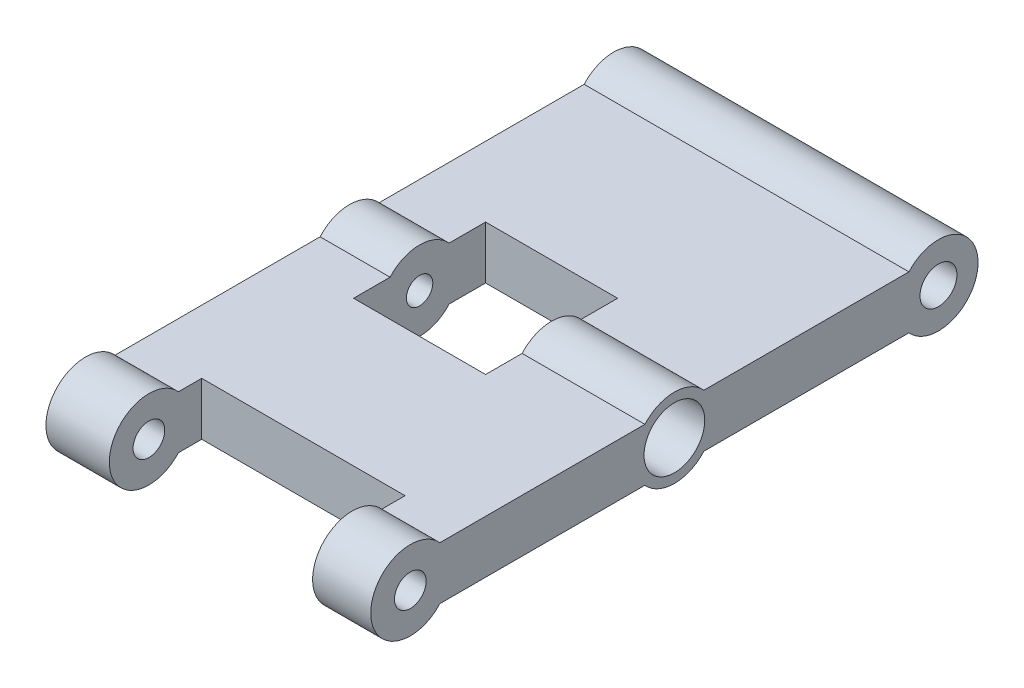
ISO-10303-21;
HEADER;
FILE_DESCRIPTION(('STEP AP214'),'2;1');
FILE_NAME('part.step','',(''),(''),'','','');
FILE_SCHEMA(('AUTOMOTIVE_DESIGN { 1 0 10303 214 1 1 1 1 }'));
ENDSEC;
DATA;
#1=APPLICATION_CONTEXT('core data for automotive mechanical design processes');
#2=APPLICATION_PROTOCOL_DEFINITION('international standard','automotive_design',2000,#1);
#3=PRODUCT_CONTEXT('',#1,'mechanical');
#4=PRODUCT('Part','Part','',(#3));
#5=PRODUCT_RELATED_PRODUCT_CATEGORY('part','',(#4));
#6=PRODUCT_DEFINITION_FORMATION('','',#4);
#7=PRODUCT_DEFINITION_CONTEXT('part definition',#1,'design');
#8=PRODUCT_DEFINITION('design','',#6,#7);
#9=PRODUCT_DEFINITION_SHAPE('','',#8);
#10=(LENGTH_UNIT() NAMED_UNIT(*) SI_UNIT(.MILLI.,.METRE.));
#11=(NAMED_UNIT(*) PLANE_ANGLE_UNIT() SI_UNIT($,.RADIAN.));
#12=(NAMED_UNIT(*) SI_UNIT($,.STERADIAN.) SOLID_ANGLE_UNIT());
#13=UNCERTAINTY_MEASURE_WITH_UNIT(LENGTH_MEASURE(1.E-05),#10,'distance_accuracy_value','');
#14=(GEOMETRIC_REPRESENTATION_CONTEXT(3) GLOBAL_UNCERTAINTY_ASSIGNED_CONTEXT((#13)) GLOBAL_UNIT_ASSIGNED_CONTEXT((#10,
#11,#12)) REPRESENTATION_CONTEXT('',''));
#15=CARTESIAN_POINT('',(0.,0.,0.));
#16=DIRECTION('',(0.,0.,1.));
#17=DIRECTION('',(1.,0.,0.));
#18=AXIS2_PLACEMENT_3D('',#15,#16,#17);
#19=CARTESIAN_POINT('',(31.242,2.54,-25.4));
#20=DIRECTION('',(-1.,0.,0.));
#21=DIRECTION('',(0.,0.,1.));
#22=AXIS2_PLACEMENT_3D('',#19,#20,#21);
#23=CYLINDRICAL_SURFACE('',#22,1.27);
#24=CARTESIAN_POINT('',(6.731,2.54,-25.4));
#25=DIRECTION('',(-1.,0.,0.));
#26=DIRECTION('',(0.,0.,1.));
#27=AXIS2_PLACEMENT_3D('',#24,#25,#26);
#28=CIRCLE('',#27,1.27);
#29=CARTESIAN_POINT('',(6.731,2.54,-24.13));
#30=VERTEX_POINT('',#29);
#31=EDGE_CURVE('E211',#30,#30,#28,.F.);
#32=CARTESIAN_POINT('',(4.191,2.54,-25.4));
#33=DIRECTION('',(-1.,0.,0.));
#34=DIRECTION('',(0.,0.,1.));
#35=AXIS2_PLACEMENT_3D('',#32,#33,#34);
#36=CIRCLE('',#35,1.27);
#37=CARTESIAN_POINT('',(4.191,2.54,-24.13));
#38=VERTEX_POINT('',#37);
#39=EDGE_CURVE('E39',#38,#38,#36,.F.);
#40=CARTESIAN_POINT('',(6.731,2.54,-24.13));
#41=CARTESIAN_POINT('',(6.70454166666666,2.54,-24.13));
#42=CARTESIAN_POINT('',(6.67808333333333,2.54,-24.13));
#43=CARTESIAN_POINT('',(6.62516666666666,2.54,-24.13));
#44=CARTESIAN_POINT('',(6.59870833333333,2.54,-24.13));
#45=CARTESIAN_POINT('',(6.54579166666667,2.54,-24.13));
#46=CARTESIAN_POINT('',(6.51933333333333,2.54,-24.13));
#47=CARTESIAN_POINT('',(6.46641666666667,2.54,-24.13));
#48=CARTESIAN_POINT('',(6.43995833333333,2.54,-24.13));
#49=CARTESIAN_POINT('',(6.38704166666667,2.54,-24.13));
#50=CARTESIAN_POINT('',(6.36058333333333,2.54,-24.13));
#51=CARTESIAN_POINT('',(6.30766666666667,2.54,-24.13));
#52=CARTESIAN_POINT('',(6.28120833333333,2.54,-24.13));
#53=CARTESIAN_POINT('',(6.22829166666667,2.54,-24.13));
#54=CARTESIAN_POINT('',(6.20183333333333,2.54,-24.13));
#55=CARTESIAN_POINT('',(6.14891666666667,2.54,-24.13));
#56=CARTESIAN_POINT('',(6.12245833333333,2.54,-24.13));
#57=CARTESIAN_POINT('',(6.06954166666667,2.54,-24.13));
#58=CARTESIAN_POINT('',(6.04308333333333,2.54,-24.13));
#59=CARTESIAN_POINT('',(5.99016666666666,2.54,-24.13));
#60=CARTESIAN_POINT('',(5.96370833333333,2.54,-24.13));
#61=CARTESIAN_POINT('',(5.91079166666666,2.54,-24.13));
#62=CARTESIAN_POINT('',(5.88433333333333,2.54,-24.13));
#63=CARTESIAN_POINT('',(5.83141666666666,2.54,-24.13));
#64=CARTESIAN_POINT('',(5.80495833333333,2.54,-24.13));
#65=CARTESIAN_POINT('',(5.75204166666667,2.54,-24.13));
#66=CARTESIAN_POINT('',(5.72558333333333,2.54,-24.13));
#67=CARTESIAN_POINT('',(5.67266666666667,2.54,-24.13));
#68=CARTESIAN_POINT('',(5.64620833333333,2.54,-24.13));
#69=CARTESIAN_POINT('',(5.59329166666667,2.54,-24.13));
#70=CARTESIAN_POINT('',(5.56683333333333,2.54,-24.13));
#71=CARTESIAN_POINT('',(5.51391666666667,2.54,-24.13));
#72=CARTESIAN_POINT('',(5.48745833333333,2.54,-24.13));
#73=CARTESIAN_POINT('',(5.43454166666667,2.54,-24.13));
#74=CARTESIAN_POINT('',(5.40808333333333,2.54,-24.13));
#75=CARTESIAN_POINT('',(5.35516666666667,2.54,-24.13));
#76=CARTESIAN_POINT('',(5.32870833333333,2.54,-24.13));
#77=CARTESIAN_POINT('',(5.27579166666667,2.54,-24.13));
#78=CARTESIAN_POINT('',(5.24933333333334,2.54,-24.13));
#79=CARTESIAN_POINT('',(5.19641666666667,2.54,-24.13));
#80=CARTESIAN_POINT('',(5.16995833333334,2.54,-24.13));
#81=CARTESIAN_POINT('',(5.11704166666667,2.54,-24.13));
#82=CARTESIAN_POINT('',(5.09058333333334,2.54,-24.13));
#83=CARTESIAN_POINT('',(5.03766666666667,2.54,-24.13));
#84=CARTESIAN_POINT('',(5.01120833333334,2.54,-24.13));
#85=CARTESIAN_POINT('',(4.95829166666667,2.54,-24.13));
#86=CARTESIAN_POINT('',(4.93183333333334,2.54,-24.13));
#87=CARTESIAN_POINT('',(4.87891666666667,2.54,-24.13));
#88=CARTESIAN_POINT('',(4.85245833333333,2.54,-24.13));
#89=CARTESIAN_POINT('',(4.79954166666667,2.54,-24.13));
#90=CARTESIAN_POINT('',(4.77308333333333,2.54,-24.13));
#91=CARTESIAN_POINT('',(4.72016666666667,2.54,-24.13));
#92=CARTESIAN_POINT('',(4.69370833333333,2.54,-24.13));
#93=CARTESIAN_POINT('',(4.64079166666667,2.54,-24.13));
#94=CARTESIAN_POINT('',(4.61433333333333,2.54,-24.13));
#95=CARTESIAN_POINT('',(4.56141666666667,2.54,-24.13));
#96=CARTESIAN_POINT('',(4.53495833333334,2.54,-24.13));
#97=CARTESIAN_POINT('',(4.48204166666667,2.54,-24.13));
#98=CARTESIAN_POINT('',(4.45558333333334,2.54,-24.13));
#99=CARTESIAN_POINT('',(4.40266666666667,2.54,-24.13));
#100=CARTESIAN_POINT('',(4.37620833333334,2.54,-24.13));
#101=CARTESIAN_POINT('',(4.32329166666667,2.54,-24.13));
#102=CARTESIAN_POINT('',(4.29683333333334,2.54,-24.13));
#103=CARTESIAN_POINT('',(4.24391666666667,2.54,-24.13));
#104=CARTESIAN_POINT('',(4.21745833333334,2.54,-24.13));
#105=CARTESIAN_POINT('',(4.191,2.54,-24.13));
#106=B_SPLINE_CURVE_WITH_KNOTS('',3,(#40,#41,#42,#43,#44,#45,#46,#47,#48,#49,#50,#51,#52,#53,
#54,#55,#56,#57,#58,#59,#60,#61,#62,#63,#64,#65,#66,#67,#68,#69,#70,#71,#72,#73,#74,#75,#76,#77,
#78,#79,#80,#81,#82,#83,#84,#85,#86,#87,#88,#89,#90,#91,#92,#93,#94,#95,#96,#97,#98,#99,#100,
#101,#102,#103,#104,#105),.UNSPECIFIED.,.F.,.F.,(4,2,2,2,2,2,2,2,2,2,2,2,2,2,2,2,2,2,2,2,2,2,2,
2,2,2,2,2,2,2,2,2,4),(0.,0.0793749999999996,0.158749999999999,0.238124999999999,
0.317499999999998,0.396874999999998,0.476249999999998,0.555624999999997,0.634999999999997,
0.714375,0.793749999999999,0.873124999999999,0.952499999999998,1.031875,1.11125,1.190625,1.27,
1.349375,1.42875,1.508125,1.5875,1.66687499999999,1.74624999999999,1.82562499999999,1.905,
1.984375,2.06375,2.143125,2.2225,2.301875,2.38124999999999,2.46062499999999,2.53999999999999),.UNSPECIFIED.);
#107=EDGE_CURVE('BSEAM35',#30,#38,#106,.T.);
#108=ORIENTED_EDGE('',*,*,#31,.T.);
#109=ORIENTED_EDGE('',*,*,#39,.F.);
#110=ORIENTED_EDGE('',*,*,#107,.T.);
#111=ORIENTED_EDGE('',*,*,#107,.F.);
#112=EDGE_LOOP('',(#108,#110,#109,#111));
#113=FACE_BOUND('',#112,.T.);
#114=ADVANCED_FACE('F35',(#113),#23,.F.);
#115=CARTESIAN_POINT('',(19.431,2.54,-25.4));
#116=DIRECTION('',(1.,0.,0.));
#117=DIRECTION('',(0.,0.,-1.));
#118=AXIS2_PLACEMENT_3D('',#115,#116,#117);
#119=CIRCLE('',#118,1.27);
#120=CARTESIAN_POINT('',(19.431,2.54,-24.13));
#121=VERTEX_POINT('',#120);
#122=EDGE_CURVE('E333',#121,#121,#119,.F.);
#123=CARTESIAN_POINT('',(21.971,2.54,-25.4));
#124=DIRECTION('',(1.,0.,0.));
#125=DIRECTION('',(0.,0.,-1.));
#126=AXIS2_PLACEMENT_3D('',#123,#124,#125);
#127=CIRCLE('',#126,1.27);
#128=CARTESIAN_POINT('',(21.971,2.54,-24.13));
#129=VERTEX_POINT('',#128);
#130=EDGE_CURVE('E338',#129,#129,#127,.F.);
#131=CARTESIAN_POINT('',(19.431,2.54,-24.13));
#132=CARTESIAN_POINT('',(19.4574583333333,2.54,-24.13));
#133=CARTESIAN_POINT('',(19.4839166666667,2.54,-24.13));
#134=CARTESIAN_POINT('',(19.5368333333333,2.54,-24.13));
#135=CARTESIAN_POINT('',(19.5632916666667,2.54,-24.13));
#136=CARTESIAN_POINT('',(19.6162083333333,2.54,-24.13));
#137=CARTESIAN_POINT('',(19.6426666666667,2.54,-24.13));
#138=CARTESIAN_POINT('',(19.6955833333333,2.54,-24.13));
#139=CARTESIAN_POINT('',(19.7220416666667,2.54,-24.13));
#140=CARTESIAN_POINT('',(19.7749583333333,2.54,-24.13));
#141=CARTESIAN_POINT('',(19.8014166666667,2.54,-24.13));
#142=CARTESIAN_POINT('',(19.8543333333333,2.54,-24.13));
#143=CARTESIAN_POINT('',(19.8807916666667,2.54,-24.13));
#144=CARTESIAN_POINT('',(19.9337083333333,2.54,-24.13));
#145=CARTESIAN_POINT('',(19.9601666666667,2.54,-24.13));
#146=CARTESIAN_POINT('',(20.0130833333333,2.54,-24.13));
#147=CARTESIAN_POINT('',(20.0395416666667,2.54,-24.13));
#148=CARTESIAN_POINT('',(20.0924583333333,2.54,-24.13));
#149=CARTESIAN_POINT('',(20.1189166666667,2.54,-24.13));
#150=CARTESIAN_POINT('',(20.1718333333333,2.54,-24.13));
#151=CARTESIAN_POINT('',(20.1982916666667,2.54,-24.13));
#152=CARTESIAN_POINT('',(20.2512083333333,2.54,-24.13));
#153=CARTESIAN_POINT('',(20.2776666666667,2.54,-24.13));
#154=CARTESIAN_POINT('',(20.3305833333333,2.54,-24.13));
#155=CARTESIAN_POINT('',(20.3570416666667,2.54,-24.13));
#156=CARTESIAN_POINT('',(20.4099583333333,2.54,-24.13));
#157=CARTESIAN_POINT('',(20.4364166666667,2.54,-24.13));
#158=CARTESIAN_POINT('',(20.4893333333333,2.54,-24.13));
#159=CARTESIAN_POINT('',(20.5157916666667,2.54,-24.13));
#160=CARTESIAN_POINT('',(20.5687083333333,2.54,-24.13));
#161=CARTESIAN_POINT('',(20.5951666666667,2.54,-24.13));
#162=CARTESIAN_POINT('',(20.6480833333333,2.54,-24.13));
#163=CARTESIAN_POINT('',(20.6745416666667,2.54,-24.13));
#164=CARTESIAN_POINT('',(20.7274583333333,2.54,-24.13));
#165=CARTESIAN_POINT('',(20.7539166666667,2.54,-24.13));
#166=CARTESIAN_POINT('',(20.8068333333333,2.54,-24.13));
#167=CARTESIAN_POINT('',(20.8332916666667,2.54,-24.13));
#168=CARTESIAN_POINT('',(20.8862083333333,2.54,-24.13));
#169=CARTESIAN_POINT('',(20.9126666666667,2.54,-24.13));
#170=CARTESIAN_POINT('',(20.9655833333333,2.54,-24.13));
#171=CARTESIAN_POINT('',(20.9920416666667,2.54,-24.13));
#172=CARTESIAN_POINT('',(21.0449583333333,2.54,-24.13));
#173=CARTESIAN_POINT('',(21.0714166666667,2.54,-24.13));
#174=CARTESIAN_POINT('',(21.1243333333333,2.54,-24.13));
#175=CARTESIAN_POINT('',(21.1507916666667,2.54,-24.13));
#176=CARTESIAN_POINT('',(21.2037083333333,2.54,-24.13));
#177=CARTESIAN_POINT('',(21.2301666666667,2.54,-24.13));
#178=CARTESIAN_POINT('',(21.2830833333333,2.54,-24.13));
#179=CARTESIAN_POINT('',(21.3095416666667,2.54,-24.13));
#180=CARTESIAN_POINT('',(21.3624583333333,2.54,-24.13));
#181=CARTESIAN_POINT('',(21.3889166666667,2.54,-24.13));
#182=CARTESIAN_POINT('',(21.4418333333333,2.54,-24.13));
#183=CARTESIAN_POINT('',(21.4682916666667,2.54,-24.13));
#184=CARTESIAN_POINT('',(21.5212083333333,2.54,-24.13));
#185=CARTESIAN_POINT('',(21.5476666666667,2.54,-24.13));
#186=CARTESIAN_POINT('',(21.6005833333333,2.54,-24.13));
#187=CARTESIAN_POINT('',(21.6270416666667,2.54,-24.13));
#188=CARTESIAN_POINT('',(21.6799583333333,2.54,-24.13));
#189=CARTESIAN_POINT('',(21.7064166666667,2.54,-24.13));
#190=CARTESIAN_POINT('',(21.7593333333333,2.54,-24.13));
#191=CARTESIAN_POINT('',(21.7857916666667,2.54,-24.13));
#192=CARTESIAN_POINT('',(21.8387083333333,2.54,-24.13));
#193=CARTESIAN_POINT('',(21.8651666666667,2.54,-24.13));
#194=CARTESIAN_POINT('',(21.9180833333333,2.54,-24.13));
#195=CARTESIAN_POINT('',(21.9445416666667,2.54,-24.13));
#196=CARTESIAN_POINT('',(21.971,2.54,-24.13));
#197=B_SPLINE_CURVE_WITH_KNOTS('',3,(#131,#132,#133,#134,#135,#136,#137,#138,#139,#140,#141,
#142,#143,#144,#145,#146,#147,#148,#149,#150,#151,#152,#153,#154,#155,#156,#157,#158,#159,#160,
#161,#162,#163,#164,#165,#166,#167,#168,#169,#170,#171,#172,#173,#174,#175,#176,#177,#178,#179,
#180,#181,#182,#183,#184,#185,#186,#187,#188,#189,#190,#191,#192,#193,#194,#195,#196),
.UNSPECIFIED.,.F.,.F.,(4,2,2,2,2,2,2,2,2,2,2,2,2,2,2,2,2,2,2,2,2,2,2,2,2,2,2,2,2,2,2,2,4),(0.,
0.0793749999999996,0.158749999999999,0.238124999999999,0.317499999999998,0.396874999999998,
0.476249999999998,0.555624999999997,0.634999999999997,0.714374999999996,0.793749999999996,
0.873124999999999,0.952499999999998,1.031875,1.11125,1.190625,1.27,1.349375,1.42875,1.508125,
1.5875,1.666875,1.74625,1.825625,1.905,1.984375,2.06375,2.143125,2.2225,2.301875,2.38125,
2.460625,2.54),.UNSPECIFIED.);
#198=EDGE_CURVE('BSEAM438',#121,#129,#197,.T.);
#199=ORIENTED_EDGE('',*,*,#122,.T.);
#200=ORIENTED_EDGE('',*,*,#130,.F.);
#201=ORIENTED_EDGE('',*,*,#198,.T.);
#202=ORIENTED_EDGE('',*,*,#198,.F.);
#203=EDGE_LOOP('',(#199,#201,#200,#202));
#204=FACE_BOUND('',#203,.T.);
#205=ADVANCED_FACE('F438',(#204),#23,.F.);
#206=CARTESIAN_POINT('',(42.018307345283,2.54,-25.4));
#207=DIRECTION('',(-1.,0.,0.));
#208=DIRECTION('',(0.,0.,1.));
#209=AXIS2_PLACEMENT_3D('',#206,#207,#208);
#210=CYLINDRICAL_SURFACE('',#209,3.81);
#211=CARTESIAN_POINT('',(19.431,2.54,-25.4));
#212=DIRECTION('',(1.,0.,0.));
#213=DIRECTION('',(0.,0.,-1.));
#214=AXIS2_PLACEMENT_3D('',#211,#212,#213);
#215=CIRCLE('',#214,3.81);
#216=CARTESIAN_POINT('',(19.431,5.08,-22.5601936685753));
#217=VERTEX_POINT('',#216);
#218=CARTESIAN_POINT('',(19.431,5.08,-28.2398063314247));
#219=VERTEX_POINT('',#218);
#220=EDGE_CURVE('E198',#217,#219,#215,.F.);
#221=ORIENTED_EDGE('',*,*,#220,.F.);
#222=DIRECTION('',(-1.,0.,0.));
#223=VECTOR('',#222,1.);
#224=CARTESIAN_POINT('',(42.018307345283,5.08,-22.5601936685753));
#225=LINE('',#224,#223);
#226=CARTESIAN_POINT('',(31.242,5.08,-22.5601936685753));
#227=VERTEX_POINT('',#226);
#228=EDGE_CURVE('E239',#227,#217,#225,.T.);
#229=ORIENTED_EDGE('',*,*,#228,.F.);
#230=CARTESIAN_POINT('',(31.242,2.54,-25.4));
#231=DIRECTION('',(-1.,0.,0.));
#232=DIRECTION('',(0.,0.,1.));
#233=AXIS2_PLACEMENT_3D('',#230,#231,#232);
#234=CIRCLE('',#233,3.81);
#235=CARTESIAN_POINT('',(31.242,5.08,-28.2398063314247));
#236=VERTEX_POINT('',#235);
#237=EDGE_CURVE('E60',#236,#227,#234,.F.);
#238=ORIENTED_EDGE('',*,*,#237,.F.);
#239=DIRECTION('',(-1.,0.,0.));
#240=VECTOR('',#239,1.);
#241=CARTESIAN_POINT('',(42.018307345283,5.08,-28.2398063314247));
#242=LINE('',#241,#240);
#243=EDGE_CURVE('E234',#219,#236,#242,.F.);
#244=ORIENTED_EDGE('',*,*,#243,.F.);
#245=EDGE_LOOP('',(#221,#229,#238,#244));
#246=FACE_BOUND('',#245,.T.);
#247=ADVANCED_FACE('F410',(#246),#210,.T.);
#248=DIRECTION('',(-1.,0.,0.));
#249=VECTOR('',#248,1.);
#250=CARTESIAN_POINT('',(42.018307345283,0.,-22.5601936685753));
#251=LINE('',#250,#249);
#252=CARTESIAN_POINT('',(19.431,0.,-22.5601936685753));
#253=VERTEX_POINT('',#252);
#254=CARTESIAN_POINT('',(31.242,0.,-22.5601936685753));
#255=VERTEX_POINT('',#254);
#256=EDGE_CURVE('E242',#253,#255,#251,.F.);
#257=ORIENTED_EDGE('',*,*,#256,.F.);
#258=CARTESIAN_POINT('',(19.431,2.54,-25.4));
#259=DIRECTION('',(1.,0.,0.));
#260=DIRECTION('',(0.,0.,-1.));
#261=AXIS2_PLACEMENT_3D('',#258,#259,#260);
#262=CIRCLE('',#261,3.81);
#263=CARTESIAN_POINT('',(19.431,0.,-28.2398063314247));
#264=VERTEX_POINT('',#263);
#265=EDGE_CURVE('E203',#264,#253,#262,.F.);
#266=ORIENTED_EDGE('',*,*,#265,.F.);
#267=DIRECTION('',(-1.,0.,0.));
#268=VECTOR('',#267,1.);
#269=CARTESIAN_POINT('',(42.018307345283,0.,-28.2398063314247));
#270=LINE('',#269,#268);
#271=CARTESIAN_POINT('',(31.242,0.,-28.2398063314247));
#272=VERTEX_POINT('',#271);
#273=EDGE_CURVE('E197',#272,#264,#270,.T.);
#274=ORIENTED_EDGE('',*,*,#273,.F.);
#275=EDGE_CURVE('E232',#255,#272,#234,.F.);
#276=ORIENTED_EDGE('',*,*,#275,.F.);
#277=EDGE_LOOP('',(#257,#266,#274,#276));
#278=FACE_BOUND('',#277,.T.);
#279=ADVANCED_FACE('F363',(#278),#210,.T.);
#280=CARTESIAN_POINT('',(31.242,0.,0.));
#281=DIRECTION('',(0.,1.,0.));
#282=DIRECTION('',(0.,0.,1.));
#283=AXIS2_PLACEMENT_3D('',#280,#281,#282);
#284=PLANE('',#283);
#285=DIRECTION('',(-1.,0.,0.));
#286=VECTOR('',#285,1.);
#287=CARTESIAN_POINT('',(31.242,0.,-31.75));
#288=LINE('',#287,#286);
#289=CARTESIAN_POINT('',(19.431,0.,-31.75));
#290=VERTEX_POINT('',#289);
#291=CARTESIAN_POINT('',(6.731,0.,-31.75));
#292=VERTEX_POINT('',#291);
#293=EDGE_CURVE('E177',#290,#292,#288,.T.);
#294=ORIENTED_EDGE('',*,*,#293,.T.);
#295=DIRECTION('',(0.,0.,1.));
#296=VECTOR('',#295,1.);
#297=CARTESIAN_POINT('',(6.731,0.,0.));
#298=LINE('',#297,#296);
#299=CARTESIAN_POINT('',(6.73099999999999,0.,-28.2398063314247));
#300=VERTEX_POINT('',#299);
#301=EDGE_CURVE('E217',#292,#300,#298,.T.);
#302=ORIENTED_EDGE('',*,*,#301,.T.);
#303=CARTESIAN_POINT('',(0.,0.,-28.2398063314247));
#304=VERTEX_POINT('',#303);
#305=EDGE_CURVE('E246',#300,#304,#270,.T.);
#306=ORIENTED_EDGE('',*,*,#305,.T.);
#307=DIRECTION('',(0.,0.,-1.));
#308=VECTOR('',#307,1.);
#309=CARTESIAN_POINT('',(0.,0.,0.));
#310=LINE('',#309,#308);
#311=CARTESIAN_POINT('',(0.,0.,-47.9601936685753));
#312=VERTEX_POINT('',#311);
#313=EDGE_CURVE('E309',#304,#312,#310,.T.);
#314=ORIENTED_EDGE('',*,*,#313,.T.);
#315=DIRECTION('',(1.,0.,0.));
#316=VECTOR('',#315,1.);
#317=CARTESIAN_POINT('',(0.,0.,-47.9601936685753));
#318=LINE('',#317,#316);
#319=CARTESIAN_POINT('',(31.242,0.,-47.9601936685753));
#320=VERTEX_POINT('',#319);
#321=EDGE_CURVE('E292',#312,#320,#318,.T.);
#322=ORIENTED_EDGE('',*,*,#321,.T.);
#323=DIRECTION('',(0.,0.,-1.));
#324=VECTOR('',#323,1.);
#325=CARTESIAN_POINT('',(31.242,0.,0.));
#326=LINE('',#325,#324);
#327=EDGE_CURVE('E314',#272,#320,#326,.T.);
#328=ORIENTED_EDGE('',*,*,#327,.F.);
#329=ORIENTED_EDGE('',*,*,#273,.T.);
#330=DIRECTION('',(0.,0.,-1.));
#331=VECTOR('',#330,1.);
#332=CARTESIAN_POINT('',(19.431,0.,0.));
#333=LINE('',#332,#331);
#334=EDGE_CURVE('E52',#264,#290,#333,.T.);
#335=ORIENTED_EDGE('',*,*,#334,.T.);
#336=EDGE_LOOP('',(#294,#302,#306,#314,#322,#328,#329,#335));
#337=FACE_BOUND('',#336,.T.);
#338=ADVANCED_FACE('F194',(#337),#284,.F.);
#339=CARTESIAN_POINT('',(31.242,5.08,0.));
#340=DIRECTION('',(0.,-1.,0.));
#341=DIRECTION('',(0.,0.,-1.));
#342=AXIS2_PLACEMENT_3D('',#339,#340,#341);
#343=PLANE('',#342);
#344=DIRECTION('',(-1.,0.,0.));
#345=VECTOR('',#344,1.);
#346=CARTESIAN_POINT('',(31.242,5.08,-19.05));
#347=LINE('',#346,#345);
#348=CARTESIAN_POINT('',(19.431,5.08,-19.05));
#349=VERTEX_POINT('',#348);
#350=CARTESIAN_POINT('',(6.731,5.08,-19.05));
#351=VERTEX_POINT('',#350);
#352=EDGE_CURVE('E185',#349,#351,#347,.T.);
#353=ORIENTED_EDGE('',*,*,#352,.T.);
#354=DIRECTION('',(0.,0.,-1.));
#355=VECTOR('',#354,1.);
#356=CARTESIAN_POINT('',(6.731,5.08,0.));
#357=LINE('',#356,#355);
#358=CARTESIAN_POINT('',(6.73099999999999,5.08,-22.5601936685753));
#359=VERTEX_POINT('',#358);
#360=EDGE_CURVE('E186',#351,#359,#357,.T.);
#361=ORIENTED_EDGE('',*,*,#360,.T.);
#362=CARTESIAN_POINT('',(0.,5.08,-22.5601936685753));
#363=VERTEX_POINT('',#362);
#364=EDGE_CURVE('E238',#359,#363,#225,.T.);
#365=ORIENTED_EDGE('',*,*,#364,.T.);
#366=DIRECTION('',(0.,0.,1.));
#367=VECTOR('',#366,1.);
#368=CARTESIAN_POINT('',(0.,5.08,0.));
#369=LINE('',#368,#367);
#370=CARTESIAN_POINT('',(0.,5.08,-2.83980633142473));
#371=VERTEX_POINT('',#370);
#372=EDGE_CURVE('E321',#363,#371,#369,.T.);
#373=ORIENTED_EDGE('',*,*,#372,.T.);
#374=DIRECTION('',(1.,0.,0.));
#375=VECTOR('',#374,1.);
#376=CARTESIAN_POINT('',(0.,5.08,-2.83980633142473));
#377=LINE('',#376,#375);
#378=CARTESIAN_POINT('',(6.096,5.08,-2.83980633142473));
#379=VERTEX_POINT('',#378);
#380=EDGE_CURVE('E302',#371,#379,#377,.T.);
#381=ORIENTED_EDGE('',*,*,#380,.T.);
#382=DIRECTION('',(0.,0.,-1.));
#383=VECTOR('',#382,1.);
#384=CARTESIAN_POINT('',(6.096,5.08,0.));
#385=LINE('',#384,#383);
#386=CARTESIAN_POINT('',(6.096,5.08,-5.08));
#387=VERTEX_POINT('',#386);
#388=EDGE_CURVE('E276',#379,#387,#385,.T.);
#389=ORIENTED_EDGE('',*,*,#388,.T.);
#390=DIRECTION('',(1.,0.,0.));
#391=VECTOR('',#390,1.);
#392=CARTESIAN_POINT('',(31.242,5.08,-5.08));
#393=LINE('',#392,#391);
#394=CARTESIAN_POINT('',(25.654,5.08,-5.08));
#395=VERTEX_POINT('',#394);
#396=EDGE_CURVE('E328',#387,#395,#393,.T.);
#397=ORIENTED_EDGE('',*,*,#396,.T.);
#398=DIRECTION('',(0.,0.,1.));
#399=VECTOR('',#398,1.);
#400=CARTESIAN_POINT('',(25.654,5.08,0.));
#401=LINE('',#400,#399);
#402=CARTESIAN_POINT('',(25.654,5.08,-2.83980633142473));
#403=VERTEX_POINT('',#402);
#404=EDGE_CURVE('E268',#395,#403,#401,.T.);
#405=ORIENTED_EDGE('',*,*,#404,.T.);
#406=CARTESIAN_POINT('',(31.242,5.08,-2.83980633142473));
#407=VERTEX_POINT('',#406);
#408=EDGE_CURVE('E299',#403,#407,#377,.T.);
#409=ORIENTED_EDGE('',*,*,#408,.T.);
#410=DIRECTION('',(0.,0.,1.));
#411=VECTOR('',#410,1.);
#412=CARTESIAN_POINT('',(31.242,5.08,0.));
#413=LINE('',#412,#411);
#414=EDGE_CURVE('E313',#227,#407,#413,.T.);
#415=ORIENTED_EDGE('',*,*,#414,.F.);
#416=ORIENTED_EDGE('',*,*,#228,.T.);
#417=DIRECTION('',(0.,0.,1.));
#418=VECTOR('',#417,1.);
#419=CARTESIAN_POINT('',(19.431,5.08,0.));
#420=LINE('',#419,#418);
#421=EDGE_CURVE('E208',#217,#349,#420,.T.);
#422=ORIENTED_EDGE('',*,*,#421,.T.);
#423=EDGE_LOOP('',(#353,#361,#365,#373,#381,#389,#397,#405,#409,#415,#416,#422));
#424=FACE_BOUND('',#423,.T.);
#425=ADVANCED_FACE('F376',(#424),#343,.F.);
#426=CARTESIAN_POINT('',(0.,2.54,0.));
#427=DIRECTION('',(1.,0.,0.));
#428=DIRECTION('',(0.,0.,-1.));
#429=AXIS2_PLACEMENT_3D('',#426,#427,#428);
#430=CYLINDRICAL_SURFACE('',#429,3.81);
#431=CARTESIAN_POINT('',(6.096,2.54,0.));
#432=DIRECTION('',(-1.,0.,0.));
#433=DIRECTION('',(0.,0.,1.));
#434=AXIS2_PLACEMENT_3D('',#431,#432,#433);
#435=CIRCLE('',#434,3.81);
#436=CARTESIAN_POINT('',(6.096,0.,-2.83980633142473));
#437=VERTEX_POINT('',#436);
#438=EDGE_CURVE('E326',#379,#437,#435,.F.);
#439=ORIENTED_EDGE('',*,*,#438,.F.);
#440=ORIENTED_EDGE('',*,*,#380,.F.);
#441=CARTESIAN_POINT('',(0.,2.54,0.));
#442=DIRECTION('',(1.,0.,0.));
#443=DIRECTION('',(0.,0.,-1.));
#444=AXIS2_PLACEMENT_3D('',#441,#442,#443);
#445=CIRCLE('',#444,3.81);
#446=CARTESIAN_POINT('',(0.,0.,-2.83980633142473));
#447=VERTEX_POINT('',#446);
#448=EDGE_CURVE('E296',#371,#447,#445,.T.);
#449=ORIENTED_EDGE('',*,*,#448,.T.);
#450=DIRECTION('',(1.,0.,0.));
#451=VECTOR('',#450,1.);
#452=CARTESIAN_POINT('',(0.,0.,-2.83980633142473));
#453=LINE('',#452,#451);
#454=EDGE_CURVE('E305',#437,#447,#453,.F.);
#455=ORIENTED_EDGE('',*,*,#454,.F.);
#456=EDGE_LOOP('',(#439,#440,#449,#455));
#457=FACE_BOUND('',#456,.T.);
#458=ADVANCED_FACE('F386',(#457),#430,.T.);
#459=CARTESIAN_POINT('',(0.,0.,-22.5601936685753));
#460=VERTEX_POINT('',#459);
#461=CARTESIAN_POINT('',(6.73099999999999,0.,-22.5601936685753));
#462=VERTEX_POINT('',#461);
#463=EDGE_CURVE('E243',#460,#462,#251,.F.);
#464=ORIENTED_EDGE('',*,*,#463,.T.);
#465=DIRECTION('',(0.,0.,1.));
#466=VECTOR('',#465,1.);
#467=CARTESIAN_POINT('',(6.731,0.,0.));
#468=LINE('',#467,#466);
#469=CARTESIAN_POINT('',(6.731,0.,-19.05));
#470=VERTEX_POINT('',#469);
#471=EDGE_CURVE('E214',#462,#470,#468,.T.);
#472=ORIENTED_EDGE('',*,*,#471,.T.);
#473=DIRECTION('',(1.,0.,0.));
#474=VECTOR('',#473,1.);
#475=CARTESIAN_POINT('',(31.242,0.,-19.05));
#476=LINE('',#475,#474);
#477=CARTESIAN_POINT('',(19.431,0.,-19.05));
#478=VERTEX_POINT('',#477);
#479=EDGE_CURVE('E12',#470,#478,#476,.T.);
#480=ORIENTED_EDGE('',*,*,#479,.T.);
#481=DIRECTION('',(0.,0.,-1.));
#482=VECTOR('',#481,1.);
#483=CARTESIAN_POINT('',(19.431,0.,0.));
#484=LINE('',#483,#482);
#485=EDGE_CURVE('E199',#478,#253,#484,.T.);
#486=ORIENTED_EDGE('',*,*,#485,.T.);
#487=ORIENTED_EDGE('',*,*,#256,.T.);
#488=CARTESIAN_POINT('',(31.242,0.,-2.83980633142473));
#489=VERTEX_POINT('',#488);
#490=EDGE_CURVE('E310',#489,#255,#326,.T.);
#491=ORIENTED_EDGE('',*,*,#490,.F.);
#492=CARTESIAN_POINT('',(25.654,0.,-2.83980633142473));
#493=VERTEX_POINT('',#492);
#494=EDGE_CURVE('E306',#489,#493,#453,.F.);
#495=ORIENTED_EDGE('',*,*,#494,.T.);
#496=DIRECTION('',(0.,0.,-1.));
#497=VECTOR('',#496,1.);
#498=CARTESIAN_POINT('',(25.654,0.,0.));
#499=LINE('',#498,#497);
#500=CARTESIAN_POINT('',(25.654,0.,-5.08));
#501=VERTEX_POINT('',#500);
#502=EDGE_CURVE('E273',#493,#501,#499,.T.);
#503=ORIENTED_EDGE('',*,*,#502,.T.);
#504=DIRECTION('',(-1.,0.,0.));
#505=VECTOR('',#504,1.);
#506=CARTESIAN_POINT('',(31.242,0.,-5.08));
#507=LINE('',#506,#505);
#508=CARTESIAN_POINT('',(6.096,0.,-5.08));
#509=VERTEX_POINT('',#508);
#510=EDGE_CURVE('E282',#501,#509,#507,.T.);
#511=ORIENTED_EDGE('',*,*,#510,.T.);
#512=DIRECTION('',(0.,0.,1.));
#513=VECTOR('',#512,1.);
#514=CARTESIAN_POINT('',(6.096,0.,0.));
#515=LINE('',#514,#513);
#516=EDGE_CURVE('E279',#509,#437,#515,.T.);
#517=ORIENTED_EDGE('',*,*,#516,.T.);
#518=ORIENTED_EDGE('',*,*,#454,.T.);
#519=EDGE_CURVE('E318',#447,#460,#310,.T.);
#520=ORIENTED_EDGE('',*,*,#519,.T.);
#521=EDGE_LOOP('',(#464,#472,#480,#486,#487,#491,#495,#503,#511,#517,#518,#520));
#522=FACE_BOUND('',#521,.T.);
#523=ADVANCED_FACE('F37',(#522),#284,.F.);
#524=CARTESIAN_POINT('',(0.,5.08,-28.2398063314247));
#525=VERTEX_POINT('',#524);
#526=CARTESIAN_POINT('',(6.73099999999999,5.08,-28.2398063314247));
#527=VERTEX_POINT('',#526);
#528=EDGE_CURVE('E235',#525,#527,#242,.F.);
#529=ORIENTED_EDGE('',*,*,#528,.T.);
#530=DIRECTION('',(0.,0.,-1.));
#531=VECTOR('',#530,1.);
#532=CARTESIAN_POINT('',(6.731,5.08,0.));
#533=LINE('',#532,#531);
#534=CARTESIAN_POINT('',(6.731,5.08,-31.75));
#535=VERTEX_POINT('',#534);
#536=EDGE_CURVE('E221',#527,#535,#533,.T.);
#537=ORIENTED_EDGE('',*,*,#536,.T.);
#538=DIRECTION('',(1.,0.,0.));
#539=VECTOR('',#538,1.);
#540=CARTESIAN_POINT('',(31.242,5.08,-31.75));
#541=LINE('',#540,#539);
#542=CARTESIAN_POINT('',(19.431,5.08,-31.75));
#543=VERTEX_POINT('',#542);
#544=EDGE_CURVE('E44',#535,#543,#541,.T.);
#545=ORIENTED_EDGE('',*,*,#544,.T.);
#546=DIRECTION('',(0.,0.,1.));
#547=VECTOR('',#546,1.);
#548=CARTESIAN_POINT('',(19.431,5.08,0.));
#549=LINE('',#548,#547);
#550=EDGE_CURVE('E190',#543,#219,#549,.T.);
#551=ORIENTED_EDGE('',*,*,#550,.T.);
#552=ORIENTED_EDGE('',*,*,#243,.T.);
#553=CARTESIAN_POINT('',(31.242,5.08,-47.9601936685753));
#554=VERTEX_POINT('',#553);
#555=EDGE_CURVE('E315',#554,#236,#413,.T.);
#556=ORIENTED_EDGE('',*,*,#555,.F.);
#557=DIRECTION('',(1.,0.,0.));
#558=VECTOR('',#557,1.);
#559=CARTESIAN_POINT('',(0.,5.08,-47.9601936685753));
#560=LINE('',#559,#558);
#561=CARTESIAN_POINT('',(0.,5.08,-47.9601936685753));
#562=VERTEX_POINT('',#561);
#563=EDGE_CURVE('E288',#554,#562,#560,.F.);
#564=ORIENTED_EDGE('',*,*,#563,.T.);
#565=EDGE_CURVE('E322',#562,#525,#369,.T.);
#566=ORIENTED_EDGE('',*,*,#565,.T.);
#567=EDGE_LOOP('',(#529,#537,#545,#551,#552,#556,#564,#566));
#568=FACE_BOUND('',#567,.T.);
#569=ADVANCED_FACE('F413',(#568),#343,.F.);
#570=CARTESIAN_POINT('',(31.242,0.,0.));
#571=DIRECTION('',(-1.,0.,0.));
#572=DIRECTION('',(0.,0.,1.));
#573=AXIS2_PLACEMENT_3D('',#570,#571,#572);
#574=PLANE('',#573);
#575=CARTESIAN_POINT('',(31.242,2.54,-25.4));
#576=DIRECTION('',(1.,0.,0.));
#577=DIRECTION('',(0.,0.,-1.));
#578=AXIS2_PLACEMENT_3D('',#575,#576,#577);
#579=CIRCLE('',#578,2.921);
#580=CARTESIAN_POINT('',(31.242,2.54,-28.321));
#581=VERTEX_POINT('',#580);
#582=EDGE_CURVE('E347',#581,#581,#579,.T.);
#583=ORIENTED_EDGE('',*,*,#582,.F.);
#584=EDGE_LOOP('',(#583));
#585=FACE_BOUND('',#584,.T.);
#586=CARTESIAN_POINT('',(31.242,2.54,0.));
#587=DIRECTION('',(-1.,0.,0.));
#588=DIRECTION('',(0.,0.,1.));
#589=AXIS2_PLACEMENT_3D('',#586,#587,#588);
#590=CIRCLE('',#589,1.524);
#591=CARTESIAN_POINT('',(31.242,2.54,1.524));
#592=VERTEX_POINT('',#591);
#593=EDGE_CURVE('E256',#592,#592,#590,.T.);
#594=ORIENTED_EDGE('',*,*,#593,.T.);
#595=EDGE_LOOP('',(#594));
#596=FACE_BOUND('',#595,.T.);
#597=ORIENTED_EDGE('',*,*,#490,.T.);
#598=ORIENTED_EDGE('',*,*,#275,.T.);
#599=ORIENTED_EDGE('',*,*,#327,.T.);
#600=CARTESIAN_POINT('',(31.242,2.54,-50.8));
#601=DIRECTION('',(1.,0.,0.));
#602=DIRECTION('',(0.,0.,-1.));
#603=AXIS2_PLACEMENT_3D('',#600,#601,#602);
#604=CIRCLE('',#603,3.81);
#605=EDGE_CURVE('E285',#320,#554,#604,.T.);
#606=ORIENTED_EDGE('',*,*,#605,.T.);
#607=ORIENTED_EDGE('',*,*,#555,.T.);
#608=ORIENTED_EDGE('',*,*,#237,.T.);
#609=ORIENTED_EDGE('',*,*,#414,.T.);
#610=CARTESIAN_POINT('',(31.242,2.54,0.));
#611=DIRECTION('',(1.,0.,0.));
#612=DIRECTION('',(0.,0.,-1.));
#613=AXIS2_PLACEMENT_3D('',#610,#611,#612);
#614=CIRCLE('',#613,3.81);
#615=EDGE_CURVE('E295',#407,#489,#614,.T.);
#616=ORIENTED_EDGE('',*,*,#615,.T.);
#617=EDGE_LOOP('',(#597,#598,#599,#606,#607,#608,#609,#616));
#618=FACE_BOUND('',#617,.T.);
#619=CARTESIAN_POINT('',(31.242,2.54,-50.8));
#620=DIRECTION('',(-1.,0.,0.));
#621=DIRECTION('',(0.,0.,1.));
#622=AXIS2_PLACEMENT_3D('',#619,#620,#621);
#623=CIRCLE('',#622,1.778);
#624=CARTESIAN_POINT('',(31.242,2.54,-49.022));
#625=VERTEX_POINT('',#624);
#626=EDGE_CURVE('E249',#625,#625,#623,.T.);
#627=ORIENTED_EDGE('',*,*,#626,.T.);
#628=EDGE_LOOP('',(#627));
#629=FACE_BOUND('',#628,.T.);
#630=ADVANCED_FACE('F364',(#585,#596,#618,#629),#574,.F.);
#631=CARTESIAN_POINT('',(0.,0.,0.));
#632=DIRECTION('',(-1.,0.,0.));
#633=DIRECTION('',(0.,0.,1.));
#634=AXIS2_PLACEMENT_3D('',#631,#632,#633);
#635=PLANE('',#634);
#636=CARTESIAN_POINT('',(0.,2.54,-25.4));
#637=DIRECTION('',(-1.,0.,0.));
#638=DIRECTION('',(0.,0.,1.));
#639=AXIS2_PLACEMENT_3D('',#636,#637,#638);
#640=CIRCLE('',#639,2.921);
#641=CARTESIAN_POINT('',(0.,2.54,-22.479));
#642=VERTEX_POINT('',#641);
#643=EDGE_CURVE('E478',#642,#642,#640,.T.);
#644=ORIENTED_EDGE('',*,*,#643,.F.);
#645=EDGE_LOOP('',(#644));
#646=FACE_BOUND('',#645,.T.);
#647=ORIENTED_EDGE('',*,*,#372,.F.);
#648=CARTESIAN_POINT('',(0.,2.54,-25.4));
#649=DIRECTION('',(-1.,0.,0.));
#650=DIRECTION('',(0.,0.,1.));
#651=AXIS2_PLACEMENT_3D('',#648,#649,#650);
#652=CIRCLE('',#651,3.81);
#653=EDGE_CURVE('E229',#363,#525,#652,.T.);
#654=ORIENTED_EDGE('',*,*,#653,.T.);
#655=ORIENTED_EDGE('',*,*,#565,.F.);
#656=CARTESIAN_POINT('',(0.,2.54,-50.8));
#657=DIRECTION('',(1.,0.,0.));
#658=DIRECTION('',(0.,0.,-1.));
#659=AXIS2_PLACEMENT_3D('',#656,#657,#658);
#660=CIRCLE('',#659,3.81);
#661=EDGE_CURVE('E286',#312,#562,#660,.T.);
#662=ORIENTED_EDGE('',*,*,#661,.F.);
#663=ORIENTED_EDGE('',*,*,#313,.F.);
#664=EDGE_CURVE('E228',#304,#460,#652,.T.);
#665=ORIENTED_EDGE('',*,*,#664,.T.);
#666=ORIENTED_EDGE('',*,*,#519,.F.);
#667=ORIENTED_EDGE('',*,*,#448,.F.);
#668=EDGE_LOOP('',(#647,#654,#655,#662,#663,#665,#666,#667));
#669=FACE_BOUND('',#668,.T.);
#670=CARTESIAN_POINT('',(0.,2.54,0.));
#671=DIRECTION('',(-1.,0.,0.));
#672=DIRECTION('',(0.,0.,1.));
#673=AXIS2_PLACEMENT_3D('',#670,#671,#672);
#674=CIRCLE('',#673,1.524);
#675=CARTESIAN_POINT('',(0.,2.54,1.524));
#676=VERTEX_POINT('',#675);
#677=EDGE_CURVE('E248',#676,#676,#674,.T.);
#678=ORIENTED_EDGE('',*,*,#677,.F.);
#679=EDGE_LOOP('',(#678));
#680=FACE_BOUND('',#679,.T.);
#681=CARTESIAN_POINT('',(0.,2.54,-50.8));
#682=DIRECTION('',(-1.,0.,0.));
#683=DIRECTION('',(0.,0.,1.));
#684=AXIS2_PLACEMENT_3D('',#681,#682,#683);
#685=CIRCLE('',#684,1.778);
#686=CARTESIAN_POINT('',(0.,2.54,-49.022));
#687=VERTEX_POINT('',#686);
#688=EDGE_CURVE('E253',#687,#687,#685,.T.);
#689=ORIENTED_EDGE('',*,*,#688,.F.);
#690=EDGE_LOOP('',(#689));
#691=FACE_BOUND('',#690,.T.);
#692=ADVANCED_FACE('F393',(#646,#669,#680,#691),#635,.T.);
#693=CARTESIAN_POINT('',(25.654,2.54,0.));
#694=DIRECTION('',(1.,0.,0.));
#695=DIRECTION('',(0.,0.,-1.));
#696=AXIS2_PLACEMENT_3D('',#693,#694,#695);
#697=CIRCLE('',#696,3.81);
#698=EDGE_CURVE('E317',#493,#403,#697,.F.);
#699=ORIENTED_EDGE('',*,*,#698,.F.);
#700=ORIENTED_EDGE('',*,*,#494,.F.);
#701=ORIENTED_EDGE('',*,*,#615,.F.);
#702=ORIENTED_EDGE('',*,*,#408,.F.);
#703=EDGE_LOOP('',(#699,#700,#701,#702));
#704=FACE_BOUND('',#703,.T.);
#705=ADVANCED_FACE('F369',(#704),#430,.T.);
#706=CARTESIAN_POINT('',(0.,2.54,-50.8));
#707=DIRECTION('',(1.,0.,0.));
#708=DIRECTION('',(0.,0.,-1.));
#709=AXIS2_PLACEMENT_3D('',#706,#707,#708);
#710=CYLINDRICAL_SURFACE('',#709,3.81);
#711=ORIENTED_EDGE('',*,*,#321,.F.);
#712=ORIENTED_EDGE('',*,*,#661,.T.);
#713=ORIENTED_EDGE('',*,*,#563,.F.);
#714=ORIENTED_EDGE('',*,*,#605,.F.);
#715=EDGE_LOOP('',(#711,#712,#713,#714));
#716=FACE_BOUND('',#715,.T.);
#717=ADVANCED_FACE('F419',(#716),#710,.T.);
#718=CARTESIAN_POINT('',(6.096,-10.795,-5.08));
#719=DIRECTION('',(0.,0.,-1.));
#720=DIRECTION('',(-1.,0.,0.));
#721=AXIS2_PLACEMENT_3D('',#718,#719,#720);
#722=PLANE('',#721);
#723=DIRECTION('',(0.,1.,0.));
#724=VECTOR('',#723,1.);
#725=CARTESIAN_POINT('',(25.654,-10.795,-5.08));
#726=LINE('',#725,#724);
#727=EDGE_CURVE('E264',#501,#395,#726,.T.);
#728=ORIENTED_EDGE('',*,*,#727,.T.);
#729=ORIENTED_EDGE('',*,*,#396,.F.);
#730=DIRECTION('',(0.,1.,0.));
#731=VECTOR('',#730,1.);
#732=CARTESIAN_POINT('',(6.096,-10.795,-5.08));
#733=LINE('',#732,#731);
#734=EDGE_CURVE('E265',#509,#387,#733,.T.);
#735=ORIENTED_EDGE('',*,*,#734,.F.);
#736=ORIENTED_EDGE('',*,*,#510,.F.);
#737=EDGE_LOOP('',(#728,#729,#735,#736));
#738=FACE_BOUND('',#737,.T.);
#739=ADVANCED_FACE('F380',(#738),#722,.F.);
#740=CARTESIAN_POINT('',(6.096,-10.795,-5.08));
#741=DIRECTION('',(-1.,0.,0.));
#742=DIRECTION('',(0.,0.,1.));
#743=AXIS2_PLACEMENT_3D('',#740,#741,#742);
#744=PLANE('',#743);
#745=CARTESIAN_POINT('',(6.096,2.54,0.));
#746=DIRECTION('',(-1.,0.,0.));
#747=DIRECTION('',(0.,0.,1.));
#748=AXIS2_PLACEMENT_3D('',#745,#746,#747);
#749=CIRCLE('',#748,1.524);
#750=CARTESIAN_POINT('',(6.096,2.54,1.524));
#751=VERTEX_POINT('',#750);
#752=EDGE_CURVE('E261',#751,#751,#749,.T.);
#753=ORIENTED_EDGE('',*,*,#752,.T.);
#754=EDGE_LOOP('',(#753));
#755=FACE_BOUND('',#754,.T.);
#756=ORIENTED_EDGE('',*,*,#734,.T.);
#757=ORIENTED_EDGE('',*,*,#388,.F.);
#758=ORIENTED_EDGE('',*,*,#438,.T.);
#759=ORIENTED_EDGE('',*,*,#516,.F.);
#760=EDGE_LOOP('',(#756,#757,#758,#759));
#761=FACE_BOUND('',#760,.T.);
#762=ADVANCED_FACE('F382',(#755,#761),#744,.F.);
#763=CARTESIAN_POINT('',(25.654,-10.795,-5.08));
#764=DIRECTION('',(1.,0.,0.));
#765=DIRECTION('',(0.,0.,-1.));
#766=AXIS2_PLACEMENT_3D('',#763,#764,#765);
#767=PLANE('',#766);
#768=CARTESIAN_POINT('',(25.654,2.54,0.));
#769=DIRECTION('',(1.,0.,0.));
#770=DIRECTION('',(0.,0.,-1.));
#771=AXIS2_PLACEMENT_3D('',#768,#769,#770);
#772=CIRCLE('',#771,1.524);
#773=CARTESIAN_POINT('',(25.654,2.54,1.524));
#774=VERTEX_POINT('',#773);
#775=EDGE_CURVE('E252',#774,#774,#772,.T.);
#776=ORIENTED_EDGE('',*,*,#775,.T.);
#777=EDGE_LOOP('',(#776));
#778=FACE_BOUND('',#777,.T.);
#779=ORIENTED_EDGE('',*,*,#698,.T.);
#780=ORIENTED_EDGE('',*,*,#404,.F.);
#781=ORIENTED_EDGE('',*,*,#727,.F.);
#782=ORIENTED_EDGE('',*,*,#502,.F.);
#783=EDGE_LOOP('',(#779,#780,#781,#782));
#784=FACE_BOUND('',#783,.T.);
#785=ADVANCED_FACE('F373',(#778,#784),#767,.F.);
#786=CARTESIAN_POINT('',(31.242,2.54,0.));
#787=DIRECTION('',(-1.,0.,0.));
#788=DIRECTION('',(0.,0.,1.));
#789=AXIS2_PLACEMENT_3D('',#786,#787,#788);
#790=CYLINDRICAL_SURFACE('',#789,1.524);
#791=CARTESIAN_POINT('',(31.242,2.54,1.524));
#792=CARTESIAN_POINT('',(31.1837916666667,2.54,1.524));
#793=CARTESIAN_POINT('',(31.1255833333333,2.54,1.524));
#794=CARTESIAN_POINT('',(31.0091666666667,2.54,1.524));
#795=CARTESIAN_POINT('',(30.9509583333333,2.54,1.524));
#796=CARTESIAN_POINT('',(30.8345416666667,2.54,1.524));
#797=CARTESIAN_POINT('',(30.7763333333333,2.54,1.524));
#798=CARTESIAN_POINT('',(30.6599166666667,2.54,1.524));
#799=CARTESIAN_POINT('',(30.6017083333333,2.54,1.524));
#800=CARTESIAN_POINT('',(30.4852916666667,2.54,1.524));
#801=CARTESIAN_POINT('',(30.4270833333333,2.54,1.524));
#802=CARTESIAN_POINT('',(30.3106666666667,2.54,1.524));
#803=CARTESIAN_POINT('',(30.2524583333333,2.54,1.524));
#804=CARTESIAN_POINT('',(30.1360416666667,2.54,1.524));
#805=CARTESIAN_POINT('',(30.0778333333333,2.54,1.524));
#806=CARTESIAN_POINT('',(29.9614166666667,2.54,1.524));
#807=CARTESIAN_POINT('',(29.9032083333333,2.54,1.524));
#808=CARTESIAN_POINT('',(29.7867916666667,2.54,1.524));
#809=CARTESIAN_POINT('',(29.7285833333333,2.54,1.524));
#810=CARTESIAN_POINT('',(29.6121666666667,2.54,1.524));
#811=CARTESIAN_POINT('',(29.5539583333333,2.54,1.524));
#812=CARTESIAN_POINT('',(29.4375416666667,2.54,1.524));
#813=CARTESIAN_POINT('',(29.3793333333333,2.54,1.524));
#814=CARTESIAN_POINT('',(29.2629166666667,2.54,1.524));
#815=CARTESIAN_POINT('',(29.2047083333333,2.54,1.524));
#816=CARTESIAN_POINT('',(29.0882916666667,2.54,1.524));
#817=CARTESIAN_POINT('',(29.0300833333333,2.54,1.524));
#818=CARTESIAN_POINT('',(28.9136666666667,2.54,1.524));
#819=CARTESIAN_POINT('',(28.8554583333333,2.54,1.524));
#820=CARTESIAN_POINT('',(28.7390416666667,2.54,1.524));
#821=CARTESIAN_POINT('',(28.6808333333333,2.54,1.524));
#822=CARTESIAN_POINT('',(28.5644166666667,2.54,1.524));
#823=CARTESIAN_POINT('',(28.5062083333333,2.54,1.524));
#824=CARTESIAN_POINT('',(28.3897916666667,2.54,1.524));
#825=CARTESIAN_POINT('',(28.3315833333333,2.54,1.524));
#826=CARTESIAN_POINT('',(28.2151666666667,2.54,1.524));
#827=CARTESIAN_POINT('',(28.1569583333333,2.54,1.524));
#828=CARTESIAN_POINT('',(28.0405416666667,2.54,1.524));
#829=CARTESIAN_POINT('',(27.9823333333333,2.54,1.524));
#830=CARTESIAN_POINT('',(27.8659166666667,2.54,1.524));
#831=CARTESIAN_POINT('',(27.8077083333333,2.54,1.524));
#832=CARTESIAN_POINT('',(27.6912916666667,2.54,1.524));
#833=CARTESIAN_POINT('',(27.6330833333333,2.54,1.524));
#834=CARTESIAN_POINT('',(27.5166666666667,2.54,1.524));
#835=CARTESIAN_POINT('',(27.4584583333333,2.54,1.524));
#836=CARTESIAN_POINT('',(27.3420416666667,2.54,1.524));
#837=CARTESIAN_POINT('',(27.2838333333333,2.54,1.524));
#838=CARTESIAN_POINT('',(27.1674166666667,2.54,1.524));
#839=CARTESIAN_POINT('',(27.1092083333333,2.54,1.524));
#840=CARTESIAN_POINT('',(26.9927916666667,2.54,1.524));
#841=CARTESIAN_POINT('',(26.9345833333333,2.54,1.524));
#842=CARTESIAN_POINT('',(26.8181666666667,2.54,1.524));
#843=CARTESIAN_POINT('',(26.7599583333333,2.54,1.524));
#844=CARTESIAN_POINT('',(26.6435416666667,2.54,1.524));
#845=CARTESIAN_POINT('',(26.5853333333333,2.54,1.524));
#846=CARTESIAN_POINT('',(26.4689166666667,2.54,1.524));
#847=CARTESIAN_POINT('',(26.4107083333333,2.54,1.524));
#848=CARTESIAN_POINT('',(26.2942916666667,2.54,1.524));
#849=CARTESIAN_POINT('',(26.2360833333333,2.54,1.524));
#850=CARTESIAN_POINT('',(26.1196666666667,2.54,1.524));
#851=CARTESIAN_POINT('',(26.0614583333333,2.54,1.524));
#852=CARTESIAN_POINT('',(25.9450416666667,2.54,1.524));
#853=CARTESIAN_POINT('',(25.8868333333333,2.54,1.524));
#854=CARTESIAN_POINT('',(25.7704166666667,2.54,1.524));
#855=CARTESIAN_POINT('',(25.7122083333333,2.54,1.524));
#856=CARTESIAN_POINT('',(25.654,2.54,1.524));
#857=B_SPLINE_CURVE_WITH_KNOTS('',3,(#791,#792,#793,#794,#795,#796,#797,#798,#799,#800,#801,
#802,#803,#804,#805,#806,#807,#808,#809,#810,#811,#812,#813,#814,#815,#816,#817,#818,#819,#820,
#821,#822,#823,#824,#825,#826,#827,#828,#829,#830,#831,#832,#833,#834,#835,#836,#837,#838,#839,
#840,#841,#842,#843,#844,#845,#846,#847,#848,#849,#850,#851,#852,#853,#854,#855,#856),
.UNSPECIFIED.,.F.,.F.,(4,2,2,2,2,2,2,2,2,2,2,2,2,2,2,2,2,2,2,2,2,2,2,2,2,2,2,2,2,2,2,2,4),(0.,
0.174625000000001,0.349250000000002,0.523875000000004,0.698500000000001,0.873125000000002,
1.04775,1.222375,1.397,1.571625,1.74625,1.920875,2.0955,2.270125,2.44475,2.619375,2.794,
2.968625,3.14325,3.317875,3.4925,3.667125,3.84175,4.016375,4.191,4.365625,4.54025,4.714875,
4.8895,5.064125,5.23875,5.413375,5.588),.UNSPECIFIED.);
#858=EDGE_CURVE('BSEAM629',#592,#774,#857,.T.);
#859=ORIENTED_EDGE('',*,*,#593,.F.);
#860=ORIENTED_EDGE('',*,*,#775,.F.);
#861=ORIENTED_EDGE('',*,*,#858,.T.);
#862=ORIENTED_EDGE('',*,*,#858,.F.);
#863=EDGE_LOOP('',(#859,#861,#860,#862));
#864=FACE_BOUND('',#863,.T.);
#865=ADVANCED_FACE('F629',(#864),#790,.F.);
#866=CARTESIAN_POINT('',(0.,2.54,1.524));
#867=CARTESIAN_POINT('',(0.0635000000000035,2.54,1.524));
#868=CARTESIAN_POINT('',(0.127000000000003,2.54,1.524));
#869=CARTESIAN_POINT('',(0.254000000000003,2.54,1.524));
#870=CARTESIAN_POINT('',(0.317500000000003,2.54,1.524));
#871=CARTESIAN_POINT('',(0.444500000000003,2.54,1.524));
#872=CARTESIAN_POINT('',(0.508000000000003,2.54,1.524));
#873=CARTESIAN_POINT('',(0.635000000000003,2.54,1.524));
#874=CARTESIAN_POINT('',(0.698500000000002,2.54,1.524));
#875=CARTESIAN_POINT('',(0.825500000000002,2.54,1.524));
#876=CARTESIAN_POINT('',(0.889000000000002,2.54,1.524));
#877=CARTESIAN_POINT('',(1.016,2.54,1.524));
#878=CARTESIAN_POINT('',(1.0795,2.54,1.524));
#879=CARTESIAN_POINT('',(1.2065,2.54,1.524));
#880=CARTESIAN_POINT('',(1.27,2.54,1.524));
#881=CARTESIAN_POINT('',(1.397,2.54,1.524));
#882=CARTESIAN_POINT('',(1.4605,2.54,1.524));
#883=CARTESIAN_POINT('',(1.5875,2.54,1.524));
#884=CARTESIAN_POINT('',(1.651,2.54,1.524));
#885=CARTESIAN_POINT('',(1.778,2.54,1.524));
#886=CARTESIAN_POINT('',(1.8415,2.54,1.524));
#887=CARTESIAN_POINT('',(1.9685,2.54,1.524));
#888=CARTESIAN_POINT('',(2.032,2.54,1.524));
#889=CARTESIAN_POINT('',(2.159,2.54,1.524));
#890=CARTESIAN_POINT('',(2.2225,2.54,1.524));
#891=CARTESIAN_POINT('',(2.3495,2.54,1.524));
#892=CARTESIAN_POINT('',(2.413,2.54,1.524));
#893=CARTESIAN_POINT('',(2.54,2.54,1.524));
#894=CARTESIAN_POINT('',(2.6035,2.54,1.524));
#895=CARTESIAN_POINT('',(2.7305,2.54,1.524));
#896=CARTESIAN_POINT('',(2.794,2.54,1.524));
#897=CARTESIAN_POINT('',(2.921,2.54,1.524));
#898=CARTESIAN_POINT('',(2.9845,2.54,1.524));
#899=CARTESIAN_POINT('',(3.1115,2.54,1.524));
#900=CARTESIAN_POINT('',(3.175,2.54,1.524));
#901=CARTESIAN_POINT('',(3.302,2.54,1.524));
#902=CARTESIAN_POINT('',(3.3655,2.54,1.524));
#903=CARTESIAN_POINT('',(3.4925,2.54,1.524));
#904=CARTESIAN_POINT('',(3.556,2.54,1.524));
#905=CARTESIAN_POINT('',(3.683,2.54,1.524));
#906=CARTESIAN_POINT('',(3.7465,2.54,1.524));
#907=CARTESIAN_POINT('',(3.8735,2.54,1.524));
#908=CARTESIAN_POINT('',(3.937,2.54,1.524));
#909=CARTESIAN_POINT('',(4.064,2.54,1.524));
#910=CARTESIAN_POINT('',(4.1275,2.54,1.524));
#911=CARTESIAN_POINT('',(4.2545,2.54,1.524));
#912=CARTESIAN_POINT('',(4.318,2.54,1.524));
#913=CARTESIAN_POINT('',(4.445,2.54,1.524));
#914=CARTESIAN_POINT('',(4.5085,2.54,1.524));
#915=CARTESIAN_POINT('',(4.6355,2.54,1.524));
#916=CARTESIAN_POINT('',(4.699,2.54,1.524));
#917=CARTESIAN_POINT('',(4.826,2.54,1.524));
#918=CARTESIAN_POINT('',(4.8895,2.54,1.524));
#919=CARTESIAN_POINT('',(5.0165,2.54,1.524));
#920=CARTESIAN_POINT('',(5.08,2.54,1.524));
#921=CARTESIAN_POINT('',(5.207,2.54,1.524));
#922=CARTESIAN_POINT('',(5.2705,2.54,1.524));
#923=CARTESIAN_POINT('',(5.3975,2.54,1.524));
#924=CARTESIAN_POINT('',(5.461,2.54,1.524));
#925=CARTESIAN_POINT('',(5.588,2.54,1.524));
#926=CARTESIAN_POINT('',(5.6515,2.54,1.524));
#927=CARTESIAN_POINT('',(5.7785,2.54,1.524));
#928=CARTESIAN_POINT('',(5.842,2.54,1.524));
#929=CARTESIAN_POINT('',(5.969,2.54,1.524));
#930=CARTESIAN_POINT('',(6.0325,2.54,1.524));
#931=CARTESIAN_POINT('',(6.096,2.54,1.524));
#932=B_SPLINE_CURVE_WITH_KNOTS('',3,(#866,#867,#868,#869,#870,#871,#872,#873,#874,#875,#876,
#877,#878,#879,#880,#881,#882,#883,#884,#885,#886,#887,#888,#889,#890,#891,#892,#893,#894,#895,
#896,#897,#898,#899,#900,#901,#902,#903,#904,#905,#906,#907,#908,#909,#910,#911,#912,#913,#914,
#915,#916,#917,#918,#919,#920,#921,#922,#923,#924,#925,#926,#927,#928,#929,#930,#931),
.UNSPECIFIED.,.F.,.F.,(4,2,2,2,2,2,2,2,2,2,2,2,2,2,2,2,2,2,2,2,2,2,2,2,2,2,2,2,2,2,2,2,4),(0.,
0.1905,0.380999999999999,0.571499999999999,0.761999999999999,0.952499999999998,1.143,1.3335,
1.524,1.7145,1.905,2.0955,2.286,2.4765,2.667,2.8575,3.048,3.2385,3.429,3.6195,3.81,4.0005,4.191,
4.3815,4.572,4.7625,4.953,5.1435,5.334,5.5245,5.715,5.9055,6.096),.UNSPECIFIED.);
#933=EDGE_CURVE('BSEAM432',#676,#751,#932,.T.);
#934=ORIENTED_EDGE('',*,*,#677,.T.);
#935=ORIENTED_EDGE('',*,*,#752,.F.);
#936=ORIENTED_EDGE('',*,*,#933,.T.);
#937=ORIENTED_EDGE('',*,*,#933,.F.);
#938=EDGE_LOOP('',(#934,#936,#935,#937));
#939=FACE_BOUND('',#938,.T.);
#940=ADVANCED_FACE('F432',(#939),#790,.F.);
#941=CARTESIAN_POINT('',(31.242,2.54,-50.8));
#942=DIRECTION('',(-1.,0.,0.));
#943=DIRECTION('',(0.,0.,1.));
#944=AXIS2_PLACEMENT_3D('',#941,#942,#943);
#945=CYLINDRICAL_SURFACE('',#944,1.778);
#946=CARTESIAN_POINT('',(31.242,2.54,-49.022));
#947=CARTESIAN_POINT('',(30.9165625,2.54,-49.022));
#948=CARTESIAN_POINT('',(30.591125,2.54,-49.022));
#949=CARTESIAN_POINT('',(29.94025,2.54,-49.022));
#950=CARTESIAN_POINT('',(29.6148125,2.54,-49.022));
#951=CARTESIAN_POINT('',(28.9639375,2.54,-49.022));
#952=CARTESIAN_POINT('',(28.6385,2.54,-49.022));
#953=CARTESIAN_POINT('',(27.987625,2.54,-49.022));
#954=CARTESIAN_POINT('',(27.6621875,2.54,-49.022));
#955=CARTESIAN_POINT('',(27.0113125,2.54,-49.022));
#956=CARTESIAN_POINT('',(26.685875,2.54,-49.022));
#957=CARTESIAN_POINT('',(26.035,2.54,-49.022));
#958=CARTESIAN_POINT('',(25.7095625,2.54,-49.022));
#959=CARTESIAN_POINT('',(25.0586875,2.54,-49.022));
#960=CARTESIAN_POINT('',(24.73325,2.54,-49.022));
#961=CARTESIAN_POINT('',(24.082375,2.54,-49.022));
#962=CARTESIAN_POINT('',(23.7569375,2.54,-49.022));
#963=CARTESIAN_POINT('',(23.1060625,2.54,-49.022));
#964=CARTESIAN_POINT('',(22.780625,2.54,-49.022));
#965=CARTESIAN_POINT('',(22.12975,2.54,-49.022));
#966=CARTESIAN_POINT('',(21.8043125,2.54,-49.022));
#967=CARTESIAN_POINT('',(21.1534375,2.54,-49.022));
#968=CARTESIAN_POINT('',(20.828,2.54,-49.022));
#969=CARTESIAN_POINT('',(20.177125,2.54,-49.022));
#970=CARTESIAN_POINT('',(19.8516875,2.54,-49.022));
#971=CARTESIAN_POINT('',(19.2008125,2.54,-49.022));
#972=CARTESIAN_POINT('',(18.875375,2.54,-49.022));
#973=CARTESIAN_POINT('',(18.2245,2.54,-49.022));
#974=CARTESIAN_POINT('',(17.8990625,2.54,-49.022));
#975=CARTESIAN_POINT('',(17.2481875,2.54,-49.022));
#976=CARTESIAN_POINT('',(16.92275,2.54,-49.022));
#977=CARTESIAN_POINT('',(16.271875,2.54,-49.022));
#978=CARTESIAN_POINT('',(15.9464375,2.54,-49.022));
#979=CARTESIAN_POINT('',(15.2955625,2.54,-49.022));
#980=CARTESIAN_POINT('',(14.970125,2.54,-49.022));
#981=CARTESIAN_POINT('',(14.31925,2.54,-49.022));
#982=CARTESIAN_POINT('',(13.9938125,2.54,-49.022));
#983=CARTESIAN_POINT('',(13.3429375,2.54,-49.022));
#984=CARTESIAN_POINT('',(13.0175,2.54,-49.022));
#985=CARTESIAN_POINT('',(12.366625,2.54,-49.022));
#986=CARTESIAN_POINT('',(12.0411875,2.54,-49.022));
#987=CARTESIAN_POINT('',(11.3903125,2.54,-49.022));
#988=CARTESIAN_POINT('',(11.064875,2.54,-49.022));
#989=CARTESIAN_POINT('',(10.414,2.54,-49.022));
#990=CARTESIAN_POINT('',(10.0885625,2.54,-49.022));
#991=CARTESIAN_POINT('',(9.4376875,2.54,-49.022));
#992=CARTESIAN_POINT('',(9.11225,2.54,-49.022));
#993=CARTESIAN_POINT('',(8.461375,2.54,-49.022));
#994=CARTESIAN_POINT('',(8.1359375,2.54,-49.022));
#995=CARTESIAN_POINT('',(7.4850625,2.54,-49.022));
#996=CARTESIAN_POINT('',(7.159625,2.54,-49.022));
#997=CARTESIAN_POINT('',(6.50875,2.54,-49.022));
#998=CARTESIAN_POINT('',(6.1833125,2.54,-49.022));
#999=CARTESIAN_POINT('',(5.5324375,2.54,-49.022));
#1000=CARTESIAN_POINT('',(5.207,2.54,-49.022));
#1001=CARTESIAN_POINT('',(4.556125,2.54,-49.022));
#1002=CARTESIAN_POINT('',(4.2306875,2.54,-49.022));
#1003=CARTESIAN_POINT('',(3.5798125,2.54,-49.022));
#1004=CARTESIAN_POINT('',(3.254375,2.54,-49.022));
#1005=CARTESIAN_POINT('',(2.6035,2.54,-49.022));
#1006=CARTESIAN_POINT('',(2.2780625,2.54,-49.022));
#1007=CARTESIAN_POINT('',(1.6271875,2.54,-49.022));
#1008=CARTESIAN_POINT('',(1.30175,2.54,-49.022));
#1009=CARTESIAN_POINT('',(0.650875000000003,2.54,-49.022));
#1010=CARTESIAN_POINT('',(0.325437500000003,2.54,-49.022));
#1011=CARTESIAN_POINT('',(0.,2.54,-49.022));
#1012=B_SPLINE_CURVE_WITH_KNOTS('',3,(#946,#947,#948,#949,#950,#951,#952,#953,#954,#955,#956,
#957,#958,#959,#960,#961,#962,#963,#964,#965,#966,#967,#968,#969,#970,#971,#972,#973,#974,#975,
#976,#977,#978,#979,#980,#981,#982,#983,#984,#985,#986,#987,#988,#989,#990,#991,#992,#993,#994,
#995,#996,#997,#998,#999,#1000,#1001,#1002,#1003,#1004,#1005,#1006,#1007,#1008,#1009,#1010,
#1011),.UNSPECIFIED.,.F.,.F.,(4,2,2,2,2,2,2,2,2,2,2,2,2,2,2,2,2,2,2,2,2,2,2,2,2,2,2,2,2,2,2,2,
4),(0.,0.9763125,1.952625,2.9289375,3.90525,4.8815625,5.857875,6.8341875,7.8105,8.7868125,
9.763125,10.7394375,11.71575,12.6920625,13.668375,14.6446875,15.621,16.5973125,17.573625,
18.5499375,19.52625,20.5025625,21.478875,22.4551875,23.4315,24.4078125,25.384125,26.3604375,
27.33675,28.3130625,29.289375,30.2656875,31.242),.UNSPECIFIED.);
#1013=EDGE_CURVE('BSEAM426',#625,#687,#1012,.T.);
#1014=ORIENTED_EDGE('',*,*,#626,.F.);
#1015=ORIENTED_EDGE('',*,*,#688,.T.);
#1016=ORIENTED_EDGE('',*,*,#1013,.T.);
#1017=ORIENTED_EDGE('',*,*,#1013,.F.);
#1018=EDGE_LOOP('',(#1014,#1016,#1015,#1017));
#1019=FACE_BOUND('',#1018,.T.);
#1020=ADVANCED_FACE('F426',(#1019),#945,.F.);
#1021=CARTESIAN_POINT('',(6.73099999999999,2.54,-25.4));
#1022=DIRECTION('',(-1.,0.,0.));
#1023=DIRECTION('',(0.,0.,1.));
#1024=AXIS2_PLACEMENT_3D('',#1021,#1022,#1023);
#1025=CIRCLE('',#1024,3.81);
#1026=EDGE_CURVE('E219',#527,#359,#1025,.F.);
#1027=ORIENTED_EDGE('',*,*,#1026,.F.);
#1028=ORIENTED_EDGE('',*,*,#528,.F.);
#1029=ORIENTED_EDGE('',*,*,#653,.F.);
#1030=ORIENTED_EDGE('',*,*,#364,.F.);
#1031=EDGE_LOOP('',(#1027,#1028,#1029,#1030));
#1032=FACE_BOUND('',#1031,.T.);
#1033=ADVANCED_FACE('F424',(#1032),#210,.T.);
#1034=CARTESIAN_POINT('',(6.73099999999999,2.54,-25.4));
#1035=DIRECTION('',(-1.,0.,0.));
#1036=DIRECTION('',(0.,0.,1.));
#1037=AXIS2_PLACEMENT_3D('',#1034,#1035,#1036);
#1038=CIRCLE('',#1037,3.81);
#1039=EDGE_CURVE('E212',#462,#300,#1038,.F.);
#1040=ORIENTED_EDGE('',*,*,#1039,.F.);
#1041=ORIENTED_EDGE('',*,*,#463,.F.);
#1042=ORIENTED_EDGE('',*,*,#664,.F.);
#1043=ORIENTED_EDGE('',*,*,#305,.F.);
#1044=EDGE_LOOP('',(#1040,#1041,#1042,#1043));
#1045=FACE_BOUND('',#1044,.T.);
#1046=ADVANCED_FACE('F399',(#1045),#210,.T.);
#1047=CARTESIAN_POINT('',(6.731,-1.27,-19.05));
#1048=DIRECTION('',(0.,0.,1.));
#1049=DIRECTION('',(1.,0.,0.));
#1050=AXIS2_PLACEMENT_3D('',#1047,#1048,#1049);
#1051=PLANE('',#1050);
#1052=DIRECTION('',(0.,1.,0.));
#1053=VECTOR('',#1052,1.);
#1054=CARTESIAN_POINT('',(19.431,-1.27,-19.05));
#1055=LINE('',#1054,#1053);
#1056=EDGE_CURVE('E191',#478,#349,#1055,.T.);
#1057=ORIENTED_EDGE('',*,*,#1056,.F.);
#1058=ORIENTED_EDGE('',*,*,#479,.F.);
#1059=DIRECTION('',(0.,1.,0.));
#1060=VECTOR('',#1059,1.);
#1061=CARTESIAN_POINT('',(6.731,-1.27,-19.05));
#1062=LINE('',#1061,#1060);
#1063=EDGE_CURVE('E340',#470,#351,#1062,.T.);
#1064=ORIENTED_EDGE('',*,*,#1063,.T.);
#1065=ORIENTED_EDGE('',*,*,#352,.F.);
#1066=EDGE_LOOP('',(#1057,#1058,#1064,#1065));
#1067=FACE_BOUND('',#1066,.T.);
#1068=ADVANCED_FACE('F405',(#1067),#1051,.F.);
#1069=CARTESIAN_POINT('',(6.731,-1.27,-31.75));
#1070=DIRECTION('',(0.,0.,-1.));
#1071=DIRECTION('',(-1.,0.,0.));
#1072=AXIS2_PLACEMENT_3D('',#1069,#1070,#1071);
#1073=PLANE('',#1072);
#1074=DIRECTION('',(0.,1.,0.));
#1075=VECTOR('',#1074,1.);
#1076=CARTESIAN_POINT('',(19.431,-1.27,-31.75));
#1077=LINE('',#1076,#1075);
#1078=EDGE_CURVE('E179',#290,#543,#1077,.T.);
#1079=ORIENTED_EDGE('',*,*,#1078,.T.);
#1080=ORIENTED_EDGE('',*,*,#544,.F.);
#1081=DIRECTION('',(0.,1.,0.));
#1082=VECTOR('',#1081,1.);
#1083=CARTESIAN_POINT('',(6.731,-1.27,-31.75));
#1084=LINE('',#1083,#1082);
#1085=EDGE_CURVE('E182',#292,#535,#1084,.T.);
#1086=ORIENTED_EDGE('',*,*,#1085,.F.);
#1087=ORIENTED_EDGE('',*,*,#293,.F.);
#1088=EDGE_LOOP('',(#1079,#1080,#1086,#1087));
#1089=FACE_BOUND('',#1088,.T.);
#1090=ADVANCED_FACE('F178',(#1089),#1073,.F.);
#1091=CARTESIAN_POINT('',(6.731,-1.27,-31.75));
#1092=DIRECTION('',(-1.,0.,0.));
#1093=DIRECTION('',(0.,0.,1.));
#1094=AXIS2_PLACEMENT_3D('',#1091,#1092,#1093);
#1095=PLANE('',#1094);
#1096=ORIENTED_EDGE('',*,*,#31,.F.);
#1097=EDGE_LOOP('',(#1096));
#1098=FACE_BOUND('',#1097,.T.);
#1099=ORIENTED_EDGE('',*,*,#1063,.F.);
#1100=ORIENTED_EDGE('',*,*,#471,.F.);
#1101=ORIENTED_EDGE('',*,*,#1039,.T.);
#1102=ORIENTED_EDGE('',*,*,#301,.F.);
#1103=ORIENTED_EDGE('',*,*,#1085,.T.);
#1104=ORIENTED_EDGE('',*,*,#536,.F.);
#1105=ORIENTED_EDGE('',*,*,#1026,.T.);
#1106=ORIENTED_EDGE('',*,*,#360,.F.);
#1107=EDGE_LOOP('',(#1099,#1100,#1101,#1102,#1103,#1104,#1105,#1106));
#1108=FACE_BOUND('',#1107,.T.);
#1109=ADVANCED_FACE('F403',(#1098,#1108),#1095,.F.);
#1110=CARTESIAN_POINT('',(19.431,-1.27,-31.75));
#1111=DIRECTION('',(1.,0.,0.));
#1112=DIRECTION('',(0.,0.,-1.));
#1113=AXIS2_PLACEMENT_3D('',#1110,#1111,#1112);
#1114=PLANE('',#1113);
#1115=ORIENTED_EDGE('',*,*,#122,.F.);
#1116=EDGE_LOOP('',(#1115));
#1117=FACE_BOUND('',#1116,.T.);
#1118=ORIENTED_EDGE('',*,*,#220,.T.);
#1119=ORIENTED_EDGE('',*,*,#550,.F.);
#1120=ORIENTED_EDGE('',*,*,#1078,.F.);
#1121=ORIENTED_EDGE('',*,*,#334,.F.);
#1122=ORIENTED_EDGE('',*,*,#265,.T.);
#1123=ORIENTED_EDGE('',*,*,#485,.F.);
#1124=ORIENTED_EDGE('',*,*,#1056,.T.);
#1125=ORIENTED_EDGE('',*,*,#421,.F.);
#1126=EDGE_LOOP('',(#1118,#1119,#1120,#1121,#1122,#1123,#1124,#1125));
#1127=FACE_BOUND('',#1126,.T.);
#1128=ADVANCED_FACE('F188',(#1117,#1127),#1114,.F.);
#1129=CARTESIAN_POINT('',(21.971,-1.27,-31.75));
#1130=DIRECTION('',(1.,0.,0.));
#1131=DIRECTION('',(0.,0.,-1.));
#1132=AXIS2_PLACEMENT_3D('',#1129,#1130,#1131);
#1133=PLANE('',#1132);
#1134=CARTESIAN_POINT('',(21.971,2.54,-25.4));
#1135=DIRECTION('',(1.,0.,0.));
#1136=DIRECTION('',(0.,0.,-1.));
#1137=AXIS2_PLACEMENT_3D('',#1134,#1135,#1136);
#1138=CIRCLE('',#1137,2.921);
#1139=CARTESIAN_POINT('',(21.971,2.54,-28.321));
#1140=VERTEX_POINT('',#1139);
#1141=EDGE_CURVE('E341',#1140,#1140,#1138,.F.);
#1142=ORIENTED_EDGE('',*,*,#1141,.F.);
#1143=EDGE_LOOP('',(#1142));
#1144=FACE_BOUND('',#1143,.T.);
#1145=ORIENTED_EDGE('',*,*,#130,.T.);
#1146=EDGE_LOOP('',(#1145));
#1147=FACE_BOUND('',#1146,.T.);
#1148=ADVANCED_FACE('F453',(#1144,#1147),#1133,.T.);
#1149=CARTESIAN_POINT('',(11.1691643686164,2.54,-25.4));
#1150=DIRECTION('',(1.,0.,0.));
#1151=DIRECTION('',(0.,0.,-1.));
#1152=AXIS2_PLACEMENT_3D('',#1149,#1150,#1151);
#1153=CYLINDRICAL_SURFACE('',#1152,2.921);
#1154=ORIENTED_EDGE('',*,*,#1141,.T.);
#1155=EDGE_LOOP('',(#1154));
#1156=FACE_BOUND('',#1155,.T.);
#1157=ORIENTED_EDGE('',*,*,#582,.T.);
#1158=EDGE_LOOP('',(#1157));
#1159=FACE_BOUND('',#1158,.T.);
#1160=ADVANCED_FACE('F457',(#1156,#1159),#1153,.F.);
#1161=CARTESIAN_POINT('',(4.191,-1.27,-31.75));
#1162=DIRECTION('',(-1.,0.,0.));
#1163=DIRECTION('',(0.,0.,1.));
#1164=AXIS2_PLACEMENT_3D('',#1161,#1162,#1163);
#1165=PLANE('',#1164);
#1166=CARTESIAN_POINT('',(4.191,2.54,-25.4));
#1167=DIRECTION('',(-1.,0.,0.));
#1168=DIRECTION('',(0.,0.,1.));
#1169=AXIS2_PLACEMENT_3D('',#1166,#1167,#1168);
#1170=CIRCLE('',#1169,2.921);
#1171=CARTESIAN_POINT('',(4.191,2.54,-22.479));
#1172=VERTEX_POINT('',#1171);
#1173=EDGE_CURVE('E475',#1172,#1172,#1170,.F.);
#1174=ORIENTED_EDGE('',*,*,#1173,.F.);
#1175=EDGE_LOOP('',(#1174));
#1176=FACE_BOUND('',#1175,.T.);
#1177=ORIENTED_EDGE('',*,*,#39,.T.);
#1178=EDGE_LOOP('',(#1177));
#1179=FACE_BOUND('',#1178,.T.);
#1180=ADVANCED_FACE('F460',(#1176,#1179),#1165,.T.);
#1181=CARTESIAN_POINT('',(14.9928356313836,2.54,-25.4));
#1182=DIRECTION('',(-1.,0.,0.));
#1183=DIRECTION('',(0.,0.,1.));
#1184=AXIS2_PLACEMENT_3D('',#1181,#1182,#1183);
#1185=CYLINDRICAL_SURFACE('',#1184,2.921);
#1186=ORIENTED_EDGE('',*,*,#1173,.T.);
#1187=EDGE_LOOP('',(#1186));
#1188=FACE_BOUND('',#1187,.T.);
#1189=ORIENTED_EDGE('',*,*,#643,.T.);
#1190=EDGE_LOOP('',(#1189));
#1191=FACE_BOUND('',#1190,.T.);
#1192=ADVANCED_FACE('F464',(#1188,#1191),#1185,.F.);
#1193=CLOSED_SHELL('',(#114,#205,#247,#279,#338,#425,#458,#523,#569,#630,#692,#705,#717,#739,
#762,#785,#865,#940,#1020,#1033,#1046,#1068,#1090,#1109,#1128,#1148,#1160,#1180,#1192));
#1194=MANIFOLD_SOLID_BREP('B2',#1193);
#1195=ADVANCED_BREP_SHAPE_REPRESENTATION('',(#18,#1194),#14);
#1196=SHAPE_DEFINITION_REPRESENTATION(#9,#1195);
ENDSEC;
END-ISO-10303-21;
